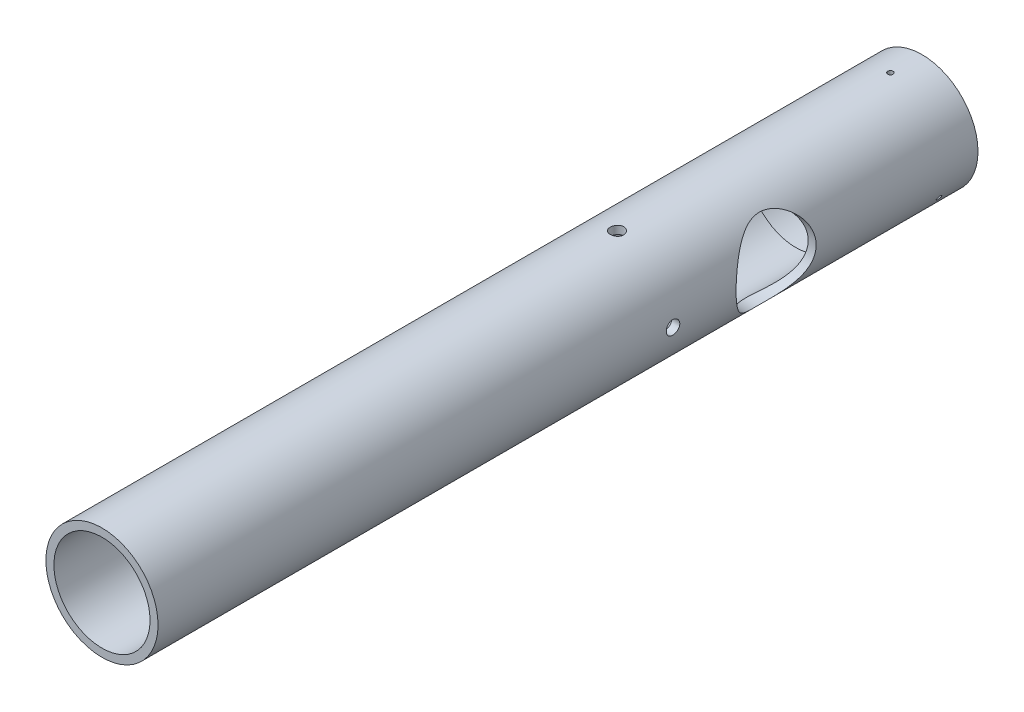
from build123d import *

# Parameters (mm, degrees)
BOSS_EXTRUDE1_DEPTH                 = 500
BOSS_EXTRUDE1_DEPTH_BACK            = 150
SKETCH1_R                           = 44.45
SKETCH1_R_2                         = 38.1
SKETCH6_R                           = 39.6508
CUT_EXTRUDE1_DEPTH                  = 554.580712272
CUT_EXTRUDE2_REACH                  = 505.936
CUT_EXTRUDE2_END_RADIUS             = 44.45
SKETCH7_R                           = 31.75
CUT_EXTRUDE2_DIRECTION_2_REACH      = 505.936
CUT_EXTRUDE2_DIRECTION_2_END_RADIUS = 44.45
M5X0_8_TAPPED_HOLE1_REACH           = 511.783
M5X0_8_TAPPED_HOLE1_BORE_R          = 2.1
CIRPATTERN2_COUNT                   = 3
F_1_2_13_TAPPED_HOLE1_REACH         = 511.783
F_1_2_13_TAPPED_HOLE1_BORE_R        = 5.35813
CIRPATTERN3_COUNT                   = 4
CHAMFER1_SIZE                       = 1


with BuildPart() as part:
    # Sketch1 → Boss-Extrude1 (new, two sides: drawn at the far end of the back side and taken through both)
    with BuildSketch(Plane.XY.offset(-BOSS_EXTRUDE1_DEPTH_BACK)):
        Circle(SKETCH1_R)
        Circle(SKETCH1_R_2, mode=Mode.SUBTRACT)
    extrude(amount=BOSS_EXTRUDE1_DEPTH + BOSS_EXTRUDE1_DEPTH_BACK)

    # Sketch6 → Cut-Extrude1 (cut, through all)
    with BuildSketch(Plane.XY.offset(-50)):
        Circle(SKETCH6_R)
    extrude(amount=-CUT_EXTRUDE1_DEPTH, mode=Mode.SUBTRACT)

    # Cut-Extrude2: up to this cylinder (the profile starts inside it)
    cut_extrude2_end = Plane(origin=(0, 0, 10), z_dir=(0, 0, 1)) * Cylinder(CUT_EXTRUDE2_END_RADIUS, 1101.772, mode=Mode.PRIVATE)
    # Sketch7 → Cut-Extrude2 (cut, up to the surface)
    with BuildSketch(Plane(origin=(0, 0, 0), x_dir=(0, 0, -1), z_dir=(1, 0, 0)), mode=Mode.PRIVATE) as cut_extrude2_sk1:
        with Locations((-10, 0)):
            Circle(SKETCH7_R)
    cut_extrude2_tool1 = extrude(cut_extrude2_sk1.sketch, amount=-CUT_EXTRUDE2_REACH, mode=Mode.PRIVATE) & cut_extrude2_end
    add(cut_extrude2_tool1.solids().sort_by_distance((0, 0, 10))[0], mode=Mode.SUBTRACT)

    # Cut-Extrude2 direction 2: up to this cylinder (the profile starts inside it)
    cut_extrude2_direction_2_end = Plane(origin=(0, 0, 10), z_dir=(0, 0, 1)) * Cylinder(CUT_EXTRUDE2_DIRECTION_2_END_RADIUS, 1101.772, mode=Mode.PRIVATE)
    # Sketch7 → Cut-Extrude2 direction 2 (cut, up to the surface)
    with BuildSketch(Plane(origin=(0, 0, 0), x_dir=(0, 0, -1), z_dir=(1, 0, 0)), mode=Mode.PRIVATE) as cut_extrude2_direction_2_sk1:
        with Locations((-10, 0)):
            Circle(SKETCH7_R)
    cut_extrude2_direction_2_tool1 = extrude(cut_extrude2_direction_2_sk1.sketch, amount=CUT_EXTRUDE2_DIRECTION_2_REACH, mode=Mode.PRIVATE) & cut_extrude2_direction_2_end
    add(cut_extrude2_direction_2_tool1.solids().sort_by_distance((0, 0, 10))[0], mode=Mode.SUBTRACT)

    # M5x0.8 Tapped Hole1 bore → M5x0.8 Tapped Hole1 (cut, up to next)
    with BuildSketch(Plane(origin=(0, 44.45, 0), x_dir=(-1, 0, 0), z_dir=(0, 1, 0)), mode=Mode.PRIVATE) as m5x0_8_tapped_hole1_sk1:
        with Locations((0, -125)):
            Circle(M5X0_8_TAPPED_HOLE1_BORE_R)
    m5x0_8_tapped_hole1_tool1 = extrude(m5x0_8_tapped_hole1_sk1.sketch, amount=-M5X0_8_TAPPED_HOLE1_REACH, mode=Mode.PRIVATE) & part.part
    m5x0_8_tapped_hole1 = m5x0_8_tapped_hole1_tool1.solids().sort_by_distance((0, 44.45, -125))[0]
    add(m5x0_8_tapped_hole1, mode=Mode.SUBTRACT)

    # CirPattern2: M5x0.8 Tapped Hole1 ×3 about axis
    cirpattern2_axis = Axis((0, 0, -150), (0, 0, 1))
    for i in range(1, CIRPATTERN2_COUNT):
        add(m5x0_8_tapped_hole1.rotate(cirpattern2_axis, i * 360 / CIRPATTERN2_COUNT), mode=Mode.SUBTRACT)

    # 1_2-13 Tapped Hole1 bore → 1_2-13 Tapped Hole1 (cut, up to next)
    with BuildSketch(Plane(origin=(0, 44.45, 0), x_dir=(-1, 0, 0), z_dir=(0, 1, 0)), mode=Mode.PRIVATE) as f_1_2_13_tapped_hole1_sk1:
        with Locations((0, 91.75)):
            Circle(F_1_2_13_TAPPED_HOLE1_BORE_R)
    f_1_2_13_tapped_hole1_tool1 = extrude(f_1_2_13_tapped_hole1_sk1.sketch, amount=-F_1_2_13_TAPPED_HOLE1_REACH, mode=Mode.PRIVATE) & part.part
    f_1_2_13_tapped_hole1 = f_1_2_13_tapped_hole1_tool1.solids().sort_by_distance((0, 44.45, 91.75))[0]
    add(f_1_2_13_tapped_hole1, mode=Mode.SUBTRACT)

    # CirPattern3: 1_2-13 Tapped Hole1 ×4 about axis
    cirpattern3_axis = Axis((0, 0, -150), (0, 0, 1))
    for i in range(1, CIRPATTERN3_COUNT):
        add(f_1_2_13_tapped_hole1.rotate(cirpattern3_axis, i * 360 / CIRPATTERN3_COUNT), mode=Mode.SUBTRACT)

    # Chamfer1
    chamfer1_edges = [part.edges().sort_by_distance(p)[0] for p in [
        (-39.6508, 0, -150),
    ]]
    chamfer(chamfer1_edges, length=CHAMFER1_SIZE)


solid = part.part
